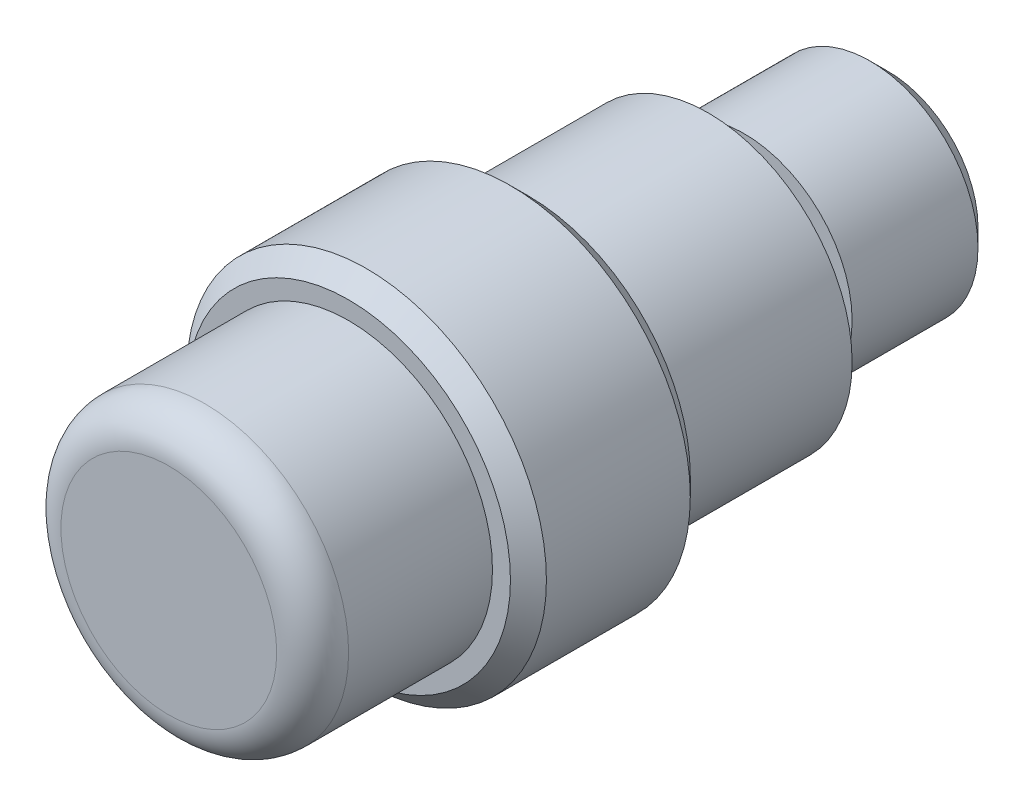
from build123d import *

# Parameters (mm, degrees)
SKETCH_1_R      = 6
EXTRUDE_1_DEPTH = 8
SKETCH_2_R      = 5
EXTRUDE_2_DEPTH = 2
SKETCH_3_R      = 8
EXTRUDE_3_DEPTH = 10
CHAMFER_1_SIZE  = 1
SKETCH_4_R      = 10
EXTRUDE_4_DEPTH = 10
SKETCH_5_R      = 8
EXTRUDE_5_DEPTH = 10
FILLET_1_R      = 2
CHAMFER_2_SIZE  = 1


with BuildPart() as part:
    # Sketch 1 → Extrude 1 (new body)
    with BuildSketch(Plane.XY):
        Circle(SKETCH_1_R)
    extrude(amount=EXTRUDE_1_DEPTH)

    # Sketch 2 → Extrude 2 (add)
    with BuildSketch(Plane.XY.offset(8)):
        Circle(SKETCH_2_R)
    extrude(amount=EXTRUDE_2_DEPTH)

    # Sketch 3 → Extrude 3 (add)
    with BuildSketch(Plane.XY.offset(10)):
        Circle(SKETCH_3_R)
    extrude(amount=EXTRUDE_3_DEPTH)

    # Chamfer 1
    chamfer_1_edges = [part.edges().sort_by_distance(p)[0] for p in [
        (-6, 0, 0),
    ]]
    chamfer(chamfer_1_edges, length=CHAMFER_1_SIZE)

    # Sketch 4 → Extrude 4 (add)
    with BuildSketch(Plane.XY.offset(20)):
        Circle(SKETCH_4_R)
    extrude(amount=EXTRUDE_4_DEPTH)

    # Sketch 5 → Extrude 5 (add)
    with BuildSketch(Plane.XY.offset(30)):
        Circle(SKETCH_5_R)
    extrude(amount=EXTRUDE_5_DEPTH)

    # Fillet 1
    fillet_1_edges = [part.edges().sort_by_distance(p)[0] for p in [
        (-8, 0, 40),
    ]]
    fillet(fillet_1_edges, radius=FILLET_1_R)

    # Chamfer 2
    chamfer_2_edges = [part.edges().sort_by_distance(p)[0] for p in [
        (-10, 0, 20),
        (-10, 0, 30),
    ]]
    chamfer(chamfer_2_edges, length=CHAMFER_2_SIZE)


solid = part.part
